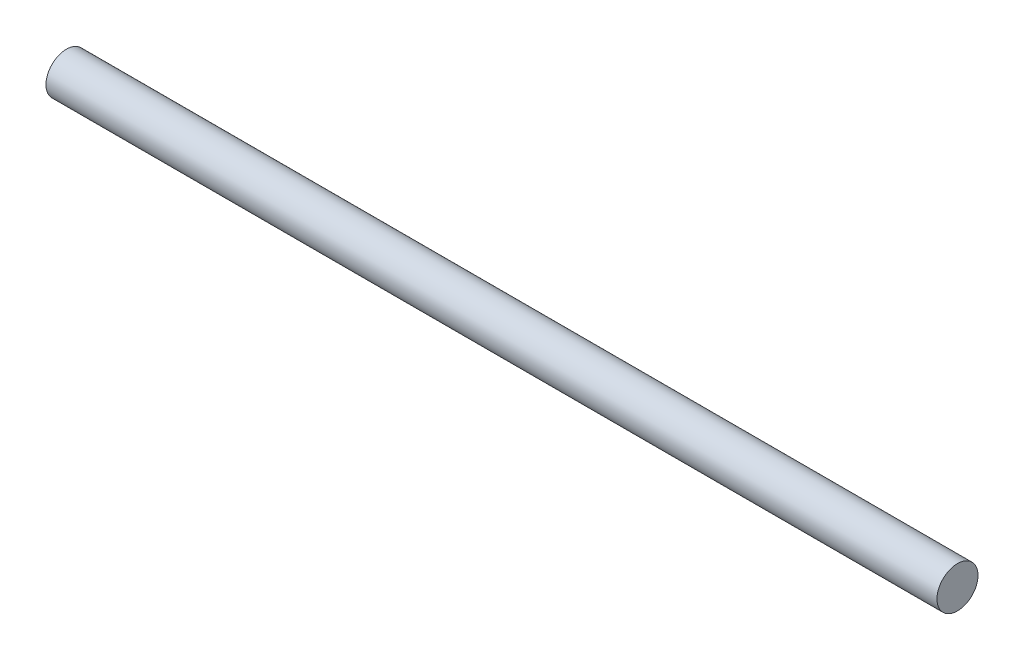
ISO-10303-21;
HEADER;
FILE_DESCRIPTION(('STEP AP214'),'2;1');
FILE_NAME('part.step','',(''),(''),'','','');
FILE_SCHEMA(('AUTOMOTIVE_DESIGN { 1 0 10303 214 1 1 1 1 }'));
ENDSEC;
DATA;
#1=APPLICATION_CONTEXT('core data for automotive mechanical design processes');
#2=APPLICATION_PROTOCOL_DEFINITION('international standard','automotive_design',2000,#1);
#3=PRODUCT_CONTEXT('',#1,'mechanical');
#4=PRODUCT('Part','Part','',(#3));
#5=PRODUCT_RELATED_PRODUCT_CATEGORY('part','',(#4));
#6=PRODUCT_DEFINITION_FORMATION('','',#4);
#7=PRODUCT_DEFINITION_CONTEXT('part definition',#1,'design');
#8=PRODUCT_DEFINITION('design','',#6,#7);
#9=PRODUCT_DEFINITION_SHAPE('','',#8);
#10=(LENGTH_UNIT() NAMED_UNIT(*) SI_UNIT(.MILLI.,.METRE.));
#11=(NAMED_UNIT(*) PLANE_ANGLE_UNIT() SI_UNIT($,.RADIAN.));
#12=(NAMED_UNIT(*) SI_UNIT($,.STERADIAN.) SOLID_ANGLE_UNIT());
#13=UNCERTAINTY_MEASURE_WITH_UNIT(LENGTH_MEASURE(1.E-05),#10,'distance_accuracy_value','');
#14=(GEOMETRIC_REPRESENTATION_CONTEXT(3) GLOBAL_UNCERTAINTY_ASSIGNED_CONTEXT((#13)) GLOBAL_UNIT_ASSIGNED_CONTEXT((#10,
#11,#12)) REPRESENTATION_CONTEXT('',''));
#15=CARTESIAN_POINT('',(0.,0.,0.));
#16=DIRECTION('',(0.,0.,1.));
#17=DIRECTION('',(1.,0.,0.));
#18=AXIS2_PLACEMENT_3D('',#15,#16,#17);
#19=CARTESIAN_POINT('',(104.775,0.,0.));
#20=DIRECTION('',(-1.,0.,0.));
#21=DIRECTION('',(0.,0.,1.));
#22=AXIS2_PLACEMENT_3D('',#19,#20,#21);
#23=CYLINDRICAL_SURFACE('',#22,2.413);
#24=CARTESIAN_POINT('',(104.775,0.,0.));
#25=DIRECTION('',(1.,0.,0.));
#26=DIRECTION('',(0.,0.,-1.));
#27=AXIS2_PLACEMENT_3D('',#24,#25,#26);
#28=CIRCLE('',#27,2.413);
#29=CARTESIAN_POINT('',(104.775,0.,-2.413));
#30=VERTEX_POINT('',#29);
#31=EDGE_CURVE('E10',#30,#30,#28,.T.);
#32=ORIENTED_EDGE('',*,*,#31,.F.);
#33=EDGE_LOOP('',(#32));
#34=FACE_BOUND('',#33,.T.);
#35=CARTESIAN_POINT('',(0.,0.,0.));
#36=DIRECTION('',(1.,0.,0.));
#37=DIRECTION('',(0.,0.,-1.));
#38=AXIS2_PLACEMENT_3D('',#35,#36,#37);
#39=CIRCLE('',#38,2.413);
#40=CARTESIAN_POINT('',(0.,0.,-2.413));
#41=VERTEX_POINT('',#40);
#42=EDGE_CURVE('E32',#41,#41,#39,.T.);
#43=ORIENTED_EDGE('',*,*,#42,.T.);
#44=EDGE_LOOP('',(#43));
#45=FACE_BOUND('',#44,.T.);
#46=ADVANCED_FACE('F26',(#34,#45),#23,.T.);
#47=CARTESIAN_POINT('',(104.775,0.,0.));
#48=DIRECTION('',(1.,0.,0.));
#49=DIRECTION('',(0.,0.,-1.));
#50=AXIS2_PLACEMENT_3D('',#47,#48,#49);
#51=PLANE('',#50);
#52=ORIENTED_EDGE('',*,*,#31,.T.);
#53=EDGE_LOOP('',(#52));
#54=FACE_BOUND('',#53,.T.);
#55=ADVANCED_FACE('F41',(#54),#51,.T.);
#56=CARTESIAN_POINT('',(0.,0.,0.));
#57=DIRECTION('',(1.,0.,0.));
#58=DIRECTION('',(0.,0.,-1.));
#59=AXIS2_PLACEMENT_3D('',#56,#57,#58);
#60=PLANE('',#59);
#61=ORIENTED_EDGE('',*,*,#42,.F.);
#62=EDGE_LOOP('',(#61));
#63=FACE_BOUND('',#62,.T.);
#64=ADVANCED_FACE('F39',(#63),#60,.F.);
#65=CLOSED_SHELL('',(#46,#55,#64));
#66=MANIFOLD_SOLID_BREP('B2',#65);
#67=ADVANCED_BREP_SHAPE_REPRESENTATION('',(#18,#66),#14);
#68=SHAPE_DEFINITION_REPRESENTATION(#9,#67);
ENDSEC;
END-ISO-10303-21;
